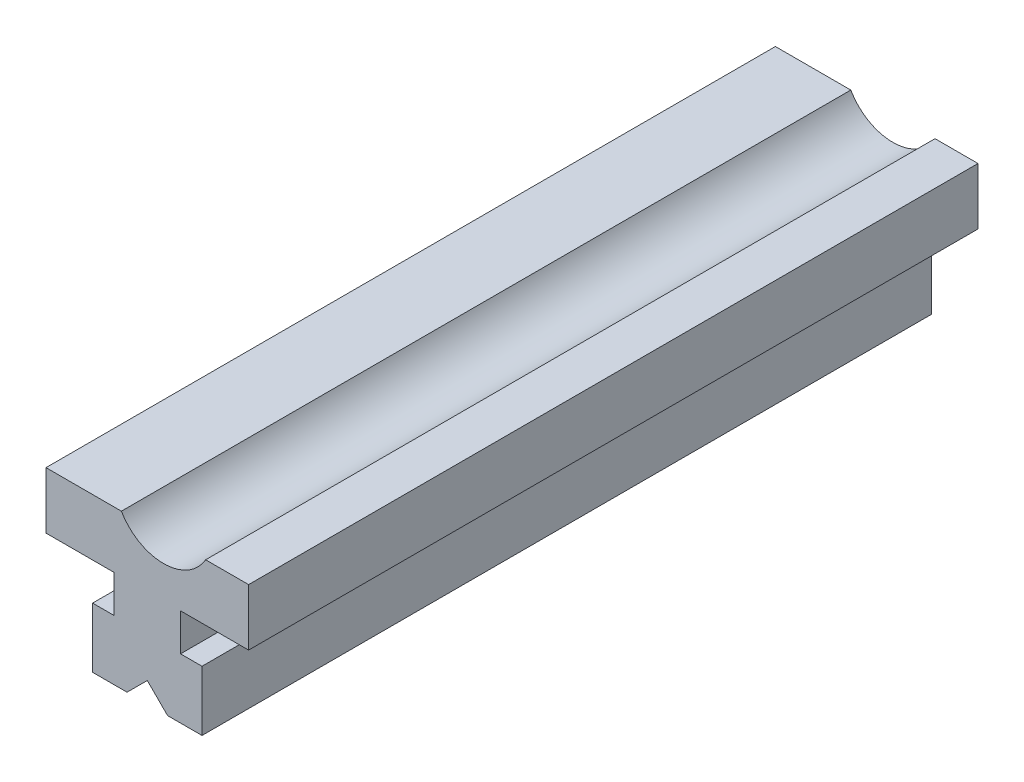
ISO-10303-21;
HEADER;
FILE_DESCRIPTION(('STEP AP214'),'2;1');
FILE_NAME('part.step','',(''),(''),'','','');
FILE_SCHEMA(('AUTOMOTIVE_DESIGN { 1 0 10303 214 1 1 1 1 }'));
ENDSEC;
DATA;
#1=APPLICATION_CONTEXT('core data for automotive mechanical design processes');
#2=APPLICATION_PROTOCOL_DEFINITION('international standard','automotive_design',2000,#1);
#3=PRODUCT_CONTEXT('',#1,'mechanical');
#4=PRODUCT('Part','Part','',(#3));
#5=PRODUCT_RELATED_PRODUCT_CATEGORY('part','',(#4));
#6=PRODUCT_DEFINITION_FORMATION('','',#4);
#7=PRODUCT_DEFINITION_CONTEXT('part definition',#1,'design');
#8=PRODUCT_DEFINITION('design','',#6,#7);
#9=PRODUCT_DEFINITION_SHAPE('','',#8);
#10=(LENGTH_UNIT() NAMED_UNIT(*) SI_UNIT(.MILLI.,.METRE.));
#11=(NAMED_UNIT(*) PLANE_ANGLE_UNIT() SI_UNIT($,.RADIAN.));
#12=(NAMED_UNIT(*) SI_UNIT($,.STERADIAN.) SOLID_ANGLE_UNIT());
#13=UNCERTAINTY_MEASURE_WITH_UNIT(LENGTH_MEASURE(1.E-05),#10,'distance_accuracy_value','');
#14=(GEOMETRIC_REPRESENTATION_CONTEXT(3) GLOBAL_UNCERTAINTY_ASSIGNED_CONTEXT((#13)) GLOBAL_UNIT_ASSIGNED_CONTEXT((#10,
#11,#12)) REPRESENTATION_CONTEXT('',''));
#15=CARTESIAN_POINT('',(0.,0.,0.));
#16=DIRECTION('',(0.,0.,1.));
#17=DIRECTION('',(1.,0.,0.));
#18=AXIS2_PLACEMENT_3D('',#15,#16,#17);
#19=CARTESIAN_POINT('',(4.10000610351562,-4.59999847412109,0.));
#20=DIRECTION('',(0.,1.,0.));
#21=DIRECTION('',(0.,0.,1.));
#22=AXIS2_PLACEMENT_3D('',#19,#20,#21);
#23=PLANE('',#22);
#24=DIRECTION('',(1.,0.,0.));
#25=VECTOR('',#24,1.);
#26=CARTESIAN_POINT('',(0.042278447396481,-4.59999847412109,-45.));
#27=LINE('',#26,#25);
#28=CARTESIAN_POINT('',(6.75,-4.59999847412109,-45.));
#29=VERTEX_POINT('',#28);
#30=CARTESIAN_POINT('',(4.10000610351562,-4.59999847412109,-45.));
#31=VERTEX_POINT('',#30);
#32=EDGE_CURVE('E171',#29,#31,#27,.F.);
#33=ORIENTED_EDGE('',*,*,#32,.T.);
#34=DIRECTION('',(0.,0.,-1.));
#35=VECTOR('',#34,1.);
#36=CARTESIAN_POINT('',(4.10000610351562,-4.59999847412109,0.));
#37=LINE('',#36,#35);
#38=CARTESIAN_POINT('',(4.10000610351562,-4.59999847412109,45.));
#39=VERTEX_POINT('',#38);
#40=EDGE_CURVE('E156',#39,#31,#37,.T.);
#41=ORIENTED_EDGE('',*,*,#40,.F.);
#42=DIRECTION('',(1.,0.,0.));
#43=VECTOR('',#42,1.);
#44=CARTESIAN_POINT('',(0.042278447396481,-4.59999847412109,45.));
#45=LINE('',#44,#43);
#46=CARTESIAN_POINT('',(6.75,-4.59999847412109,45.));
#47=VERTEX_POINT('',#46);
#48=EDGE_CURVE('E80',#47,#39,#45,.F.);
#49=ORIENTED_EDGE('',*,*,#48,.F.);
#50=DIRECTION('',(0.,0.,-1.));
#51=VECTOR('',#50,1.);
#52=CARTESIAN_POINT('',(6.75,-4.59999847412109,0.));
#53=LINE('',#52,#51);
#54=EDGE_CURVE('E110',#29,#47,#53,.F.);
#55=ORIENTED_EDGE('',*,*,#54,.F.);
#56=EDGE_LOOP('',(#33,#41,#49,#55));
#57=FACE_BOUND('',#56,.T.);
#58=ADVANCED_FACE('F16',(#57),#23,.T.);
#59=CARTESIAN_POINT('',(4.10000610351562,0.,0.));
#60=DIRECTION('',(1.,0.,0.));
#61=DIRECTION('',(0.,0.,-1.));
#62=AXIS2_PLACEMENT_3D('',#59,#60,#61);
#63=PLANE('',#62);
#64=DIRECTION('',(0.,1.,0.));
#65=VECTOR('',#64,1.);
#66=CARTESIAN_POINT('',(4.10000610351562,-1.25802262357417,-45.));
#67=LINE('',#66,#65);
#68=CARTESIAN_POINT('',(4.10000610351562,0.,-45.));
#69=VERTEX_POINT('',#68);
#70=EDGE_CURVE('E170',#31,#69,#67,.T.);
#71=ORIENTED_EDGE('',*,*,#70,.T.);
#72=DIRECTION('',(0.,0.,-1.));
#73=VECTOR('',#72,1.);
#74=CARTESIAN_POINT('',(4.10000610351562,0.,0.));
#75=LINE('',#74,#73);
#76=CARTESIAN_POINT('',(4.10000610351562,0.,45.));
#77=VERTEX_POINT('',#76);
#78=EDGE_CURVE('E150',#77,#69,#75,.T.);
#79=ORIENTED_EDGE('',*,*,#78,.F.);
#80=DIRECTION('',(0.,1.,0.));
#81=VECTOR('',#80,1.);
#82=CARTESIAN_POINT('',(4.10000610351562,-1.25802262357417,45.));
#83=LINE('',#82,#81);
#84=EDGE_CURVE('E153',#39,#77,#83,.T.);
#85=ORIENTED_EDGE('',*,*,#84,.F.);
#86=ORIENTED_EDGE('',*,*,#40,.T.);
#87=EDGE_LOOP('',(#71,#79,#85,#86));
#88=FACE_BOUND('',#87,.T.);
#89=ADVANCED_FACE('F180',(#88),#63,.T.);
#90=CARTESIAN_POINT('',(12.5,0.,0.));
#91=DIRECTION('',(0.,-1.,0.));
#92=DIRECTION('',(0.,0.,-1.));
#93=AXIS2_PLACEMENT_3D('',#90,#91,#92);
#94=PLANE('',#93);
#95=DIRECTION('',(1.,0.,0.));
#96=VECTOR('',#95,1.);
#97=CARTESIAN_POINT('',(0.042278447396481,0.,-45.));
#98=LINE('',#97,#96);
#99=CARTESIAN_POINT('',(12.5,0.,-45.));
#100=VERTEX_POINT('',#99);
#101=EDGE_CURVE('E144',#69,#100,#98,.T.);
#102=ORIENTED_EDGE('',*,*,#101,.T.);
#103=DIRECTION('',(0.,0.,-1.));
#104=VECTOR('',#103,1.);
#105=CARTESIAN_POINT('',(12.5,0.,0.));
#106=LINE('',#105,#104);
#107=CARTESIAN_POINT('',(12.5,0.,45.));
#108=VERTEX_POINT('',#107);
#109=EDGE_CURVE('E135',#108,#100,#106,.T.);
#110=ORIENTED_EDGE('',*,*,#109,.F.);
#111=DIRECTION('',(1.,0.,0.));
#112=VECTOR('',#111,1.);
#113=CARTESIAN_POINT('',(0.042278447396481,0.,45.));
#114=LINE('',#113,#112);
#115=EDGE_CURVE('E147',#77,#108,#114,.T.);
#116=ORIENTED_EDGE('',*,*,#115,.F.);
#117=ORIENTED_EDGE('',*,*,#78,.T.);
#118=EDGE_LOOP('',(#102,#110,#116,#117));
#119=FACE_BOUND('',#118,.T.);
#120=ADVANCED_FACE('F280',(#119),#94,.T.);
#121=CARTESIAN_POINT('',(12.5,7.,0.));
#122=DIRECTION('',(1.,0.,0.));
#123=DIRECTION('',(0.,0.,-1.));
#124=AXIS2_PLACEMENT_3D('',#121,#122,#123);
#125=PLANE('',#124);
#126=DIRECTION('',(0.,1.,0.));
#127=VECTOR('',#126,1.);
#128=CARTESIAN_POINT('',(12.5,-1.25802262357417,-45.));
#129=LINE('',#128,#127);
#130=CARTESIAN_POINT('',(12.5,7.,-45.));
#131=VERTEX_POINT('',#130);
#132=EDGE_CURVE('E59',#100,#131,#129,.T.);
#133=ORIENTED_EDGE('',*,*,#132,.T.);
#134=DIRECTION('',(0.,0.,1.));
#135=VECTOR('',#134,1.);
#136=CARTESIAN_POINT('',(12.5,7.,0.));
#137=LINE('',#136,#135);
#138=CARTESIAN_POINT('',(12.5,7.,45.));
#139=VERTEX_POINT('',#138);
#140=EDGE_CURVE('E81',#139,#131,#137,.F.);
#141=ORIENTED_EDGE('',*,*,#140,.F.);
#142=DIRECTION('',(0.,1.,0.));
#143=VECTOR('',#142,1.);
#144=CARTESIAN_POINT('',(12.5,-1.25802262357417,45.));
#145=LINE('',#144,#143);
#146=EDGE_CURVE('E145',#108,#139,#145,.T.);
#147=ORIENTED_EDGE('',*,*,#146,.F.);
#148=ORIENTED_EDGE('',*,*,#109,.T.);
#149=EDGE_LOOP('',(#133,#141,#147,#148));
#150=FACE_BOUND('',#149,.T.);
#151=ADVANCED_FACE('F282',(#150),#125,.T.);
#152=CARTESIAN_POINT('',(-12.5,0.,0.));
#153=DIRECTION('',(-1.,0.,0.));
#154=DIRECTION('',(0.,0.,1.));
#155=AXIS2_PLACEMENT_3D('',#152,#153,#154);
#156=PLANE('',#155);
#157=DIRECTION('',(0.,1.,0.));
#158=VECTOR('',#157,1.);
#159=CARTESIAN_POINT('',(-12.5,-1.25802262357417,-45.));
#160=LINE('',#159,#158);
#161=CARTESIAN_POINT('',(-12.5,7.,-45.));
#162=VERTEX_POINT('',#161);
#163=CARTESIAN_POINT('',(-12.5,0.,-45.));
#164=VERTEX_POINT('',#163);
#165=EDGE_CURVE('E55',#162,#164,#160,.F.);
#166=ORIENTED_EDGE('',*,*,#165,.T.);
#167=DIRECTION('',(0.,0.,-1.));
#168=VECTOR('',#167,1.);
#169=CARTESIAN_POINT('',(-12.5,0.,0.));
#170=LINE('',#169,#168);
#171=CARTESIAN_POINT('',(-12.5,0.,45.));
#172=VERTEX_POINT('',#171);
#173=EDGE_CURVE('E132',#172,#164,#170,.T.);
#174=ORIENTED_EDGE('',*,*,#173,.F.);
#175=DIRECTION('',(0.,1.,0.));
#176=VECTOR('',#175,1.);
#177=CARTESIAN_POINT('',(-12.5,-1.25802262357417,45.));
#178=LINE('',#177,#176);
#179=CARTESIAN_POINT('',(-12.5,7.00000000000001,45.));
#180=VERTEX_POINT('',#179);
#181=EDGE_CURVE('E138',#180,#172,#178,.F.);
#182=ORIENTED_EDGE('',*,*,#181,.F.);
#183=DIRECTION('',(0.,0.,1.));
#184=VECTOR('',#183,1.);
#185=CARTESIAN_POINT('',(-12.5,7.,0.));
#186=LINE('',#185,#184);
#187=EDGE_CURVE('E136',#162,#180,#186,.T.);
#188=ORIENTED_EDGE('',*,*,#187,.F.);
#189=EDGE_LOOP('',(#166,#174,#182,#188));
#190=FACE_BOUND('',#189,.T.);
#191=ADVANCED_FACE('F323',(#190),#156,.T.);
#192=CARTESIAN_POINT('',(-4.10000610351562,0.,0.));
#193=DIRECTION('',(0.,-1.,0.));
#194=DIRECTION('',(0.,0.,-1.));
#195=AXIS2_PLACEMENT_3D('',#192,#193,#194);
#196=PLANE('',#195);
#197=DIRECTION('',(1.,0.,0.));
#198=VECTOR('',#197,1.);
#199=CARTESIAN_POINT('',(0.042278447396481,0.,-45.));
#200=LINE('',#199,#198);
#201=CARTESIAN_POINT('',(-4.10000610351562,0.,-45.));
#202=VERTEX_POINT('',#201);
#203=EDGE_CURVE('E104',#164,#202,#200,.T.);
#204=ORIENTED_EDGE('',*,*,#203,.T.);
#205=DIRECTION('',(0.,0.,1.));
#206=VECTOR('',#205,1.);
#207=CARTESIAN_POINT('',(-4.10000610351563,0.,0.));
#208=LINE('',#207,#206);
#209=CARTESIAN_POINT('',(-4.10000610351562,0.,45.));
#210=VERTEX_POINT('',#209);
#211=EDGE_CURVE('E129',#210,#202,#208,.F.);
#212=ORIENTED_EDGE('',*,*,#211,.F.);
#213=DIRECTION('',(1.,0.,0.));
#214=VECTOR('',#213,1.);
#215=CARTESIAN_POINT('',(0.042278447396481,0.,45.));
#216=LINE('',#215,#214);
#217=EDGE_CURVE('E141',#172,#210,#216,.T.);
#218=ORIENTED_EDGE('',*,*,#217,.F.);
#219=ORIENTED_EDGE('',*,*,#173,.T.);
#220=EDGE_LOOP('',(#204,#212,#218,#219));
#221=FACE_BOUND('',#220,.T.);
#222=ADVANCED_FACE('F320',(#221),#196,.T.);
#223=CARTESIAN_POINT('',(-4.10000610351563,-4.59999847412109,0.));
#224=DIRECTION('',(-1.,0.,0.));
#225=DIRECTION('',(0.,0.,1.));
#226=AXIS2_PLACEMENT_3D('',#223,#224,#225);
#227=PLANE('',#226);
#228=DIRECTION('',(0.,1.,0.));
#229=VECTOR('',#228,1.);
#230=CARTESIAN_POINT('',(-4.10000610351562,-1.25802262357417,-45.));
#231=LINE('',#230,#229);
#232=CARTESIAN_POINT('',(-4.10000610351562,-4.59999847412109,-45.));
#233=VERTEX_POINT('',#232);
#234=EDGE_CURVE('E101',#202,#233,#231,.F.);
#235=ORIENTED_EDGE('',*,*,#234,.T.);
#236=DIRECTION('',(0.,0.,1.));
#237=VECTOR('',#236,1.);
#238=CARTESIAN_POINT('',(-4.10000610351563,-4.59999847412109,0.));
#239=LINE('',#238,#237);
#240=CARTESIAN_POINT('',(-4.10000610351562,-4.59999847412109,45.));
#241=VERTEX_POINT('',#240);
#242=EDGE_CURVE('E126',#241,#233,#239,.F.);
#243=ORIENTED_EDGE('',*,*,#242,.F.);
#244=DIRECTION('',(0.,1.,0.));
#245=VECTOR('',#244,1.);
#246=CARTESIAN_POINT('',(-4.10000610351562,-1.25802262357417,45.));
#247=LINE('',#246,#245);
#248=EDGE_CURVE('E288',#210,#241,#247,.F.);
#249=ORIENTED_EDGE('',*,*,#248,.F.);
#250=ORIENTED_EDGE('',*,*,#211,.T.);
#251=EDGE_LOOP('',(#235,#243,#249,#250));
#252=FACE_BOUND('',#251,.T.);
#253=ADVANCED_FACE('F315',(#252),#227,.T.);
#254=CARTESIAN_POINT('',(-6.75,-4.59999847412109,0.));
#255=DIRECTION('',(0.,1.,0.));
#256=DIRECTION('',(0.,0.,1.));
#257=AXIS2_PLACEMENT_3D('',#254,#255,#256);
#258=PLANE('',#257);
#259=DIRECTION('',(1.,0.,0.));
#260=VECTOR('',#259,1.);
#261=CARTESIAN_POINT('',(0.042278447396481,-4.59999847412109,-45.));
#262=LINE('',#261,#260);
#263=CARTESIAN_POINT('',(-6.75,-4.59999847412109,-45.));
#264=VERTEX_POINT('',#263);
#265=EDGE_CURVE('E98',#233,#264,#262,.F.);
#266=ORIENTED_EDGE('',*,*,#265,.T.);
#267=DIRECTION('',(0.,0.,1.));
#268=VECTOR('',#267,1.);
#269=CARTESIAN_POINT('',(-6.75,-4.59999847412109,0.));
#270=LINE('',#269,#268);
#271=CARTESIAN_POINT('',(-6.75,-4.59999847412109,45.));
#272=VERTEX_POINT('',#271);
#273=EDGE_CURVE('E123',#272,#264,#270,.F.);
#274=ORIENTED_EDGE('',*,*,#273,.F.);
#275=DIRECTION('',(1.,0.,0.));
#276=VECTOR('',#275,1.);
#277=CARTESIAN_POINT('',(0.042278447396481,-4.59999847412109,45.));
#278=LINE('',#277,#276);
#279=EDGE_CURVE('E290',#241,#272,#278,.F.);
#280=ORIENTED_EDGE('',*,*,#279,.F.);
#281=ORIENTED_EDGE('',*,*,#242,.T.);
#282=EDGE_LOOP('',(#266,#274,#280,#281));
#283=FACE_BOUND('',#282,.T.);
#284=ADVANCED_FACE('F311',(#283),#258,.T.);
#285=CARTESIAN_POINT('',(-6.75,-12.,0.));
#286=DIRECTION('',(-1.,0.,0.));
#287=DIRECTION('',(0.,0.,1.));
#288=AXIS2_PLACEMENT_3D('',#285,#286,#287);
#289=PLANE('',#288);
#290=DIRECTION('',(0.,1.,0.));
#291=VECTOR('',#290,1.);
#292=CARTESIAN_POINT('',(-6.75,-1.25802262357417,-45.));
#293=LINE('',#292,#291);
#294=CARTESIAN_POINT('',(-6.75,-12.,-45.));
#295=VERTEX_POINT('',#294);
#296=EDGE_CURVE('E95',#264,#295,#293,.F.);
#297=ORIENTED_EDGE('',*,*,#296,.T.);
#298=DIRECTION('',(0.,0.,-1.));
#299=VECTOR('',#298,1.);
#300=CARTESIAN_POINT('',(-6.75,-12.,0.));
#301=LINE('',#300,#299);
#302=CARTESIAN_POINT('',(-6.75,-12.,45.));
#303=VERTEX_POINT('',#302);
#304=EDGE_CURVE('E120',#303,#295,#301,.T.);
#305=ORIENTED_EDGE('',*,*,#304,.F.);
#306=DIRECTION('',(0.,1.,0.));
#307=VECTOR('',#306,1.);
#308=CARTESIAN_POINT('',(-6.75,-1.25802262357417,45.));
#309=LINE('',#308,#307);
#310=EDGE_CURVE('E292',#272,#303,#309,.F.);
#311=ORIENTED_EDGE('',*,*,#310,.F.);
#312=ORIENTED_EDGE('',*,*,#273,.T.);
#313=EDGE_LOOP('',(#297,#305,#311,#312));
#314=FACE_BOUND('',#313,.T.);
#315=ADVANCED_FACE('F307',(#314),#289,.T.);
#316=CARTESIAN_POINT('',(-2.5,-12.,0.));
#317=DIRECTION('',(0.,-1.,0.));
#318=DIRECTION('',(0.,0.,-1.));
#319=AXIS2_PLACEMENT_3D('',#316,#317,#318);
#320=PLANE('',#319);
#321=DIRECTION('',(1.,0.,0.));
#322=VECTOR('',#321,1.);
#323=CARTESIAN_POINT('',(0.042278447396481,-12.,-45.));
#324=LINE('',#323,#322);
#325=CARTESIAN_POINT('',(-2.5,-12.,-45.));
#326=VERTEX_POINT('',#325);
#327=EDGE_CURVE('E92',#295,#326,#324,.T.);
#328=ORIENTED_EDGE('',*,*,#327,.T.);
#329=DIRECTION('',(0.,0.,1.));
#330=VECTOR('',#329,1.);
#331=CARTESIAN_POINT('',(-2.5,-12.,0.));
#332=LINE('',#331,#330);
#333=CARTESIAN_POINT('',(-2.5,-12.,45.));
#334=VERTEX_POINT('',#333);
#335=EDGE_CURVE('E117',#334,#326,#332,.F.);
#336=ORIENTED_EDGE('',*,*,#335,.F.);
#337=DIRECTION('',(1.,0.,0.));
#338=VECTOR('',#337,1.);
#339=CARTESIAN_POINT('',(0.042278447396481,-12.,45.));
#340=LINE('',#339,#338);
#341=EDGE_CURVE('E294',#303,#334,#340,.T.);
#342=ORIENTED_EDGE('',*,*,#341,.F.);
#343=ORIENTED_EDGE('',*,*,#304,.T.);
#344=EDGE_LOOP('',(#328,#336,#342,#343));
#345=FACE_BOUND('',#344,.T.);
#346=ADVANCED_FACE('F302',(#345),#320,.T.);
#347=CARTESIAN_POINT('',(0.,-9.5,0.));
#348=DIRECTION('',(0.707106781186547,-0.707106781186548,0.));
#349=DIRECTION('',(0.707106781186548,0.707106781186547,0.));
#350=AXIS2_PLACEMENT_3D('',#347,#348,#349);
#351=PLANE('',#350);
#352=DIRECTION('',(0.707106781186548,0.707106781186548,0.));
#353=VECTOR('',#352,1.);
#354=CARTESIAN_POINT('',(-2.5,-12.,-45.));
#355=LINE('',#354,#353);
#356=CARTESIAN_POINT('',(0.,-9.5,-45.));
#357=VERTEX_POINT('',#356);
#358=EDGE_CURVE('E89',#326,#357,#355,.T.);
#359=ORIENTED_EDGE('',*,*,#358,.T.);
#360=DIRECTION('',(0.,0.,1.));
#361=VECTOR('',#360,1.);
#362=CARTESIAN_POINT('',(0.,-9.5,0.));
#363=LINE('',#362,#361);
#364=CARTESIAN_POINT('',(0.,-9.5,45.));
#365=VERTEX_POINT('',#364);
#366=EDGE_CURVE('E114',#365,#357,#363,.F.);
#367=ORIENTED_EDGE('',*,*,#366,.F.);
#368=DIRECTION('',(0.707106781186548,0.707106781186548,0.));
#369=VECTOR('',#368,1.);
#370=CARTESIAN_POINT('',(-2.5,-12.,45.));
#371=LINE('',#370,#369);
#372=EDGE_CURVE('E234',#334,#365,#371,.T.);
#373=ORIENTED_EDGE('',*,*,#372,.F.);
#374=ORIENTED_EDGE('',*,*,#335,.T.);
#375=EDGE_LOOP('',(#359,#367,#373,#374));
#376=FACE_BOUND('',#375,.T.);
#377=ADVANCED_FACE('F232',(#376),#351,.T.);
#378=CARTESIAN_POINT('',(2.5,-12.,0.));
#379=DIRECTION('',(-0.707106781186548,-0.707106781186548,0.));
#380=DIRECTION('',(0.707106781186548,-0.707106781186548,0.));
#381=AXIS2_PLACEMENT_3D('',#378,#379,#380);
#382=PLANE('',#381);
#383=DIRECTION('',(0.707106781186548,-0.707106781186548,0.));
#384=VECTOR('',#383,1.);
#385=CARTESIAN_POINT('',(0.,-9.5,-45.));
#386=LINE('',#385,#384);
#387=CARTESIAN_POINT('',(2.5,-12.,-45.));
#388=VERTEX_POINT('',#387);
#389=EDGE_CURVE('E86',#357,#388,#386,.T.);
#390=ORIENTED_EDGE('',*,*,#389,.T.);
#391=DIRECTION('',(0.,0.,-1.));
#392=VECTOR('',#391,1.);
#393=CARTESIAN_POINT('',(2.5,-12.,0.));
#394=LINE('',#393,#392);
#395=CARTESIAN_POINT('',(2.5,-12.,45.));
#396=VERTEX_POINT('',#395);
#397=EDGE_CURVE('E111',#396,#388,#394,.T.);
#398=ORIENTED_EDGE('',*,*,#397,.F.);
#399=DIRECTION('',(0.707106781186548,-0.707106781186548,0.));
#400=VECTOR('',#399,1.);
#401=CARTESIAN_POINT('',(0.,-9.5,45.));
#402=LINE('',#401,#400);
#403=EDGE_CURVE('E211',#365,#396,#402,.T.);
#404=ORIENTED_EDGE('',*,*,#403,.F.);
#405=ORIENTED_EDGE('',*,*,#366,.T.);
#406=EDGE_LOOP('',(#390,#398,#404,#405));
#407=FACE_BOUND('',#406,.T.);
#408=ADVANCED_FACE('F225',(#407),#382,.T.);
#409=CARTESIAN_POINT('',(6.75,-12.,0.));
#410=DIRECTION('',(0.,-1.,0.));
#411=DIRECTION('',(0.,0.,-1.));
#412=AXIS2_PLACEMENT_3D('',#409,#410,#411);
#413=PLANE('',#412);
#414=DIRECTION('',(1.,0.,0.));
#415=VECTOR('',#414,1.);
#416=CARTESIAN_POINT('',(0.042278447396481,-12.,-45.));
#417=LINE('',#416,#415);
#418=CARTESIAN_POINT('',(6.75,-12.,-45.));
#419=VERTEX_POINT('',#418);
#420=EDGE_CURVE('E82',#388,#419,#417,.T.);
#421=ORIENTED_EDGE('',*,*,#420,.T.);
#422=DIRECTION('',(0.,0.,-1.));
#423=VECTOR('',#422,1.);
#424=CARTESIAN_POINT('',(6.75,-12.,0.));
#425=LINE('',#424,#423);
#426=CARTESIAN_POINT('',(6.75,-12.,45.));
#427=VERTEX_POINT('',#426);
#428=EDGE_CURVE('E107',#427,#419,#425,.T.);
#429=ORIENTED_EDGE('',*,*,#428,.F.);
#430=DIRECTION('',(1.,0.,0.));
#431=VECTOR('',#430,1.);
#432=CARTESIAN_POINT('',(0.042278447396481,-12.,45.));
#433=LINE('',#432,#431);
#434=EDGE_CURVE('E73',#396,#427,#433,.T.);
#435=ORIENTED_EDGE('',*,*,#434,.F.);
#436=ORIENTED_EDGE('',*,*,#397,.T.);
#437=EDGE_LOOP('',(#421,#429,#435,#436));
#438=FACE_BOUND('',#437,.T.);
#439=ADVANCED_FACE('F216',(#438),#413,.T.);
#440=CARTESIAN_POINT('',(6.75,-4.59999847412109,0.));
#441=DIRECTION('',(1.,0.,0.));
#442=DIRECTION('',(0.,0.,-1.));
#443=AXIS2_PLACEMENT_3D('',#440,#441,#442);
#444=PLANE('',#443);
#445=DIRECTION('',(0.,1.,0.));
#446=VECTOR('',#445,1.);
#447=CARTESIAN_POINT('',(6.75,-1.25802262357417,-45.));
#448=LINE('',#447,#446);
#449=EDGE_CURVE('E85',#419,#29,#448,.T.);
#450=ORIENTED_EDGE('',*,*,#449,.T.);
#451=ORIENTED_EDGE('',*,*,#54,.T.);
#452=DIRECTION('',(0.,1.,0.));
#453=VECTOR('',#452,1.);
#454=CARTESIAN_POINT('',(6.75,-1.25802262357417,45.));
#455=LINE('',#454,#453);
#456=EDGE_CURVE('E70',#427,#47,#455,.T.);
#457=ORIENTED_EDGE('',*,*,#456,.F.);
#458=ORIENTED_EDGE('',*,*,#428,.T.);
#459=EDGE_LOOP('',(#450,#451,#457,#458));
#460=FACE_BOUND('',#459,.T.);
#461=ADVANCED_FACE('F201',(#460),#444,.T.);
#462=CARTESIAN_POINT('',(-12.5,7.,0.));
#463=DIRECTION('',(0.,1.,0.));
#464=DIRECTION('',(0.,0.,1.));
#465=AXIS2_PLACEMENT_3D('',#462,#463,#464);
#466=PLANE('',#465);
#467=DIRECTION('',(1.,0.,0.));
#468=VECTOR('',#467,1.);
#469=CARTESIAN_POINT('',(0.042278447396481,7.00000000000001,-45.));
#470=LINE('',#469,#468);
#471=CARTESIAN_POINT('',(-3.19615242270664,7.00000000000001,-45.));
#472=VERTEX_POINT('',#471);
#473=EDGE_CURVE('E47',#472,#162,#470,.F.);
#474=ORIENTED_EDGE('',*,*,#473,.T.);
#475=ORIENTED_EDGE('',*,*,#187,.T.);
#476=DIRECTION('',(1.,0.,0.));
#477=VECTOR('',#476,1.);
#478=CARTESIAN_POINT('',(0.042278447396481,7.00000000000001,45.));
#479=LINE('',#478,#477);
#480=CARTESIAN_POINT('',(-3.19615242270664,7.00000000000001,45.));
#481=VERTEX_POINT('',#480);
#482=EDGE_CURVE('E69',#481,#180,#479,.F.);
#483=ORIENTED_EDGE('',*,*,#482,.F.);
#484=DIRECTION('',(0.,0.,1.));
#485=VECTOR('',#484,1.);
#486=CARTESIAN_POINT('',(-3.19615242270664,7.00000000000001,0.));
#487=LINE('',#486,#485);
#488=EDGE_CURVE('E64',#481,#472,#487,.F.);
#489=ORIENTED_EDGE('',*,*,#488,.T.);
#490=EDGE_LOOP('',(#474,#475,#483,#489));
#491=FACE_BOUND('',#490,.T.);
#492=ADVANCED_FACE('F67',(#491),#466,.T.);
#493=CARTESIAN_POINT('',(0.042278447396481,-1.25802262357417,-45.));
#494=DIRECTION('',(0.,0.,1.));
#495=DIRECTION('',(1.,0.,0.));
#496=AXIS2_PLACEMENT_3D('',#493,#494,#495);
#497=PLANE('',#496);
#498=ORIENTED_EDGE('',*,*,#70,.F.);
#499=ORIENTED_EDGE('',*,*,#32,.F.);
#500=ORIENTED_EDGE('',*,*,#449,.F.);
#501=ORIENTED_EDGE('',*,*,#420,.F.);
#502=ORIENTED_EDGE('',*,*,#389,.F.);
#503=ORIENTED_EDGE('',*,*,#358,.F.);
#504=ORIENTED_EDGE('',*,*,#327,.F.);
#505=ORIENTED_EDGE('',*,*,#296,.F.);
#506=ORIENTED_EDGE('',*,*,#265,.F.);
#507=ORIENTED_EDGE('',*,*,#234,.F.);
#508=ORIENTED_EDGE('',*,*,#203,.F.);
#509=ORIENTED_EDGE('',*,*,#165,.F.);
#510=ORIENTED_EDGE('',*,*,#473,.F.);
#511=CARTESIAN_POINT('',(2.,10.,-45.));
#512=DIRECTION('',(0.,0.,1.));
#513=DIRECTION('',(1.,0.,0.));
#514=AXIS2_PLACEMENT_3D('',#511,#512,#513);
#515=CIRCLE('',#514,6.);
#516=CARTESIAN_POINT('',(7.19615242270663,7.,-45.));
#517=VERTEX_POINT('',#516);
#518=EDGE_CURVE('E19',#472,#517,#515,.T.);
#519=ORIENTED_EDGE('',*,*,#518,.T.);
#520=DIRECTION('',(1.,0.,0.));
#521=VECTOR('',#520,1.);
#522=CARTESIAN_POINT('',(7.19615242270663,7.,-45.));
#523=LINE('',#522,#521);
#524=EDGE_CURVE('E78',#131,#517,#523,.F.);
#525=ORIENTED_EDGE('',*,*,#524,.F.);
#526=ORIENTED_EDGE('',*,*,#132,.F.);
#527=ORIENTED_EDGE('',*,*,#101,.F.);
#528=EDGE_LOOP('',(#498,#499,#500,#501,#502,#503,#504,#505,#506,#507,#508,#509,#510,#519,#525,
#526,#527));
#529=FACE_BOUND('',#528,.T.);
#530=ADVANCED_FACE('F50',(#529),#497,.F.);
#531=CARTESIAN_POINT('',(7.19615242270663,7.,0.));
#532=DIRECTION('',(0.,1.,0.));
#533=DIRECTION('',(0.,0.,1.));
#534=AXIS2_PLACEMENT_3D('',#531,#532,#533);
#535=PLANE('',#534);
#536=ORIENTED_EDGE('',*,*,#524,.T.);
#537=DIRECTION('',(0.,0.,1.));
#538=VECTOR('',#537,1.);
#539=CARTESIAN_POINT('',(7.19615242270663,7.,0.));
#540=LINE('',#539,#538);
#541=CARTESIAN_POINT('',(7.19615242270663,7.,45.));
#542=VERTEX_POINT('',#541);
#543=EDGE_CURVE('E25',#517,#542,#540,.T.);
#544=ORIENTED_EDGE('',*,*,#543,.T.);
#545=DIRECTION('',(1.,0.,0.));
#546=VECTOR('',#545,1.);
#547=CARTESIAN_POINT('',(0.042278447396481,7.,45.));
#548=LINE('',#547,#546);
#549=EDGE_CURVE('E31',#139,#542,#548,.F.);
#550=ORIENTED_EDGE('',*,*,#549,.F.);
#551=ORIENTED_EDGE('',*,*,#140,.T.);
#552=EDGE_LOOP('',(#536,#544,#550,#551));
#553=FACE_BOUND('',#552,.T.);
#554=ADVANCED_FACE('F284',(#553),#535,.T.);
#555=CARTESIAN_POINT('',(0.042278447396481,-1.25802262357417,45.));
#556=DIRECTION('',(0.,0.,1.));
#557=DIRECTION('',(1.,0.,0.));
#558=AXIS2_PLACEMENT_3D('',#555,#556,#557);
#559=PLANE('',#558);
#560=ORIENTED_EDGE('',*,*,#434,.T.);
#561=ORIENTED_EDGE('',*,*,#456,.T.);
#562=ORIENTED_EDGE('',*,*,#48,.T.);
#563=ORIENTED_EDGE('',*,*,#84,.T.);
#564=ORIENTED_EDGE('',*,*,#115,.T.);
#565=ORIENTED_EDGE('',*,*,#146,.T.);
#566=ORIENTED_EDGE('',*,*,#549,.T.);
#567=CARTESIAN_POINT('',(2.,10.,45.));
#568=DIRECTION('',(0.,0.,1.));
#569=DIRECTION('',(1.,0.,0.));
#570=AXIS2_PLACEMENT_3D('',#567,#568,#569);
#571=CIRCLE('',#570,6.);
#572=EDGE_CURVE('E11',#542,#481,#571,.F.);
#573=ORIENTED_EDGE('',*,*,#572,.T.);
#574=ORIENTED_EDGE('',*,*,#482,.T.);
#575=ORIENTED_EDGE('',*,*,#181,.T.);
#576=ORIENTED_EDGE('',*,*,#217,.T.);
#577=ORIENTED_EDGE('',*,*,#248,.T.);
#578=ORIENTED_EDGE('',*,*,#279,.T.);
#579=ORIENTED_EDGE('',*,*,#310,.T.);
#580=ORIENTED_EDGE('',*,*,#341,.T.);
#581=ORIENTED_EDGE('',*,*,#372,.T.);
#582=ORIENTED_EDGE('',*,*,#403,.T.);
#583=EDGE_LOOP('',(#560,#561,#562,#563,#564,#565,#566,#573,#574,#575,#576,#577,#578,#579,#580,
#581,#582));
#584=FACE_BOUND('',#583,.T.);
#585=ADVANCED_FACE('F204',(#584),#559,.T.);
#586=CARTESIAN_POINT('',(2.,10.,0.));
#587=DIRECTION('',(0.,0.,1.));
#588=DIRECTION('',(1.,0.,0.));
#589=AXIS2_PLACEMENT_3D('',#586,#587,#588);
#590=CYLINDRICAL_SURFACE('',#589,6.);
#591=ORIENTED_EDGE('',*,*,#543,.F.);
#592=ORIENTED_EDGE('',*,*,#518,.F.);
#593=ORIENTED_EDGE('',*,*,#488,.F.);
#594=ORIENTED_EDGE('',*,*,#572,.F.);
#595=EDGE_LOOP('',(#591,#592,#593,#594));
#596=FACE_BOUND('',#595,.T.);
#597=ADVANCED_FACE('F63',(#596),#590,.F.);
#598=CLOSED_SHELL('',(#58,#89,#120,#151,#191,#222,#253,#284,#315,#346,#377,#408,#439,#461,#492,
#530,#554,#585,#597));
#599=MANIFOLD_SOLID_BREP('B1',#598);
#600=ADVANCED_BREP_SHAPE_REPRESENTATION('',(#18,#599),#14);
#601=SHAPE_DEFINITION_REPRESENTATION(#9,#600);
ENDSEC;
END-ISO-10303-21;
